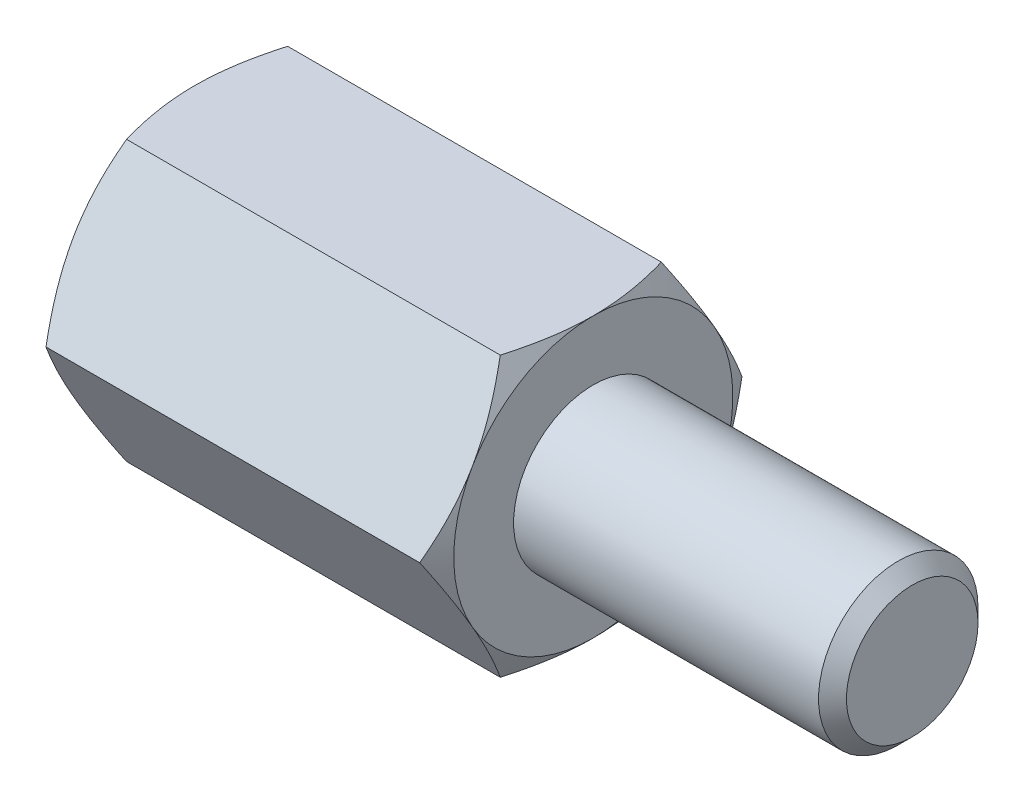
from build123d import *

# Parameters (mm, degrees)
EXTRUDE2_DEPTH = 5
SKETCH3_R      = 1.65
EXTRUDE3_DEPTH = 5
SKETCH5_R      = 2
EXTRUDE4_DEPTH = 8
CHAMFER1_SIZE  = 0.35


with BuildPart() as part:
    # Sketch1 → Extrude2 (new, symmetric)
    with BuildSketch(Plane(origin=(0, 0, 0), x_dir=(0, 0, -1), z_dir=(1, 0, 0))):
        Polygon((2.020725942, 3.5), (-2.020725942, 3.5), (-4.041451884, 0), (-2.020725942, -3.5), (2.020725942, -3.5), (4.041451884, 0), align=None)
    extrude(amount=EXTRUDE2_DEPTH, both=True)

    # Sketch2 → Cut-Revolve1 (revolve, cut)
    with BuildSketch(Plane.XY):
        with BuildLine():
            Line((-5, 3.5), (-3.5, 6.098076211))
            ThreePointArc((-3.5, 6.098076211), (-3.98810136, 7.276457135), (-5, 6.5))
            Line((-5, 6.5), (-5, 3.5))
        make_face()
    cut_revolve1 = revolve(axis=Axis((0, 0, 0), (1, 0, 0)), mode=Mode.SUBTRACT)

    # Mirror1: Cut-Revolve1 across plane
    add(cut_revolve1.mirror(Plane(origin=(0, 0, 0), x_dir=(0, 0, 1), z_dir=(1, 0, 0))), mode=Mode.SUBTRACT)

    # Sketch3 → Extrude3 (cut)
    with BuildSketch(Plane.ZY.offset(5)):
        Circle(SKETCH3_R)
    extrude(amount=-EXTRUDE3_DEPTH, mode=Mode.SUBTRACT)

    # Sketch4 → Cut-Revolve2 (revolve, cut)
    with BuildSketch(Plane.XY, mode=Mode.PRIVATE) as cut_revolve2_sk:
        Polygon((0, 0), (0, 1.65), (0.952627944, 0), align=None)
    revolve(cut_revolve2_sk.sketch.rotate(Axis((0.952627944, 0, 0), (-1, 0, 0)), 270), axis=Axis((0.952627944, 0, 0), (-1, 0, 0)), mode=Mode.SUBTRACT)

    # Sketch5 → Extrude4 (add)
    with BuildSketch(Plane(origin=(5, 0, 0), x_dir=(0, 0, -1), z_dir=(1, 0, 0))):
        Circle(SKETCH5_R)
    extrude(amount=EXTRUDE4_DEPTH)

    # Chamfer1
    chamfer1_edges = [part.edges().sort_by_distance(p)[0] for p in [
        (13, 0, 2),
    ]]
    chamfer(chamfer1_edges, length=CHAMFER1_SIZE)


solid = part.part
